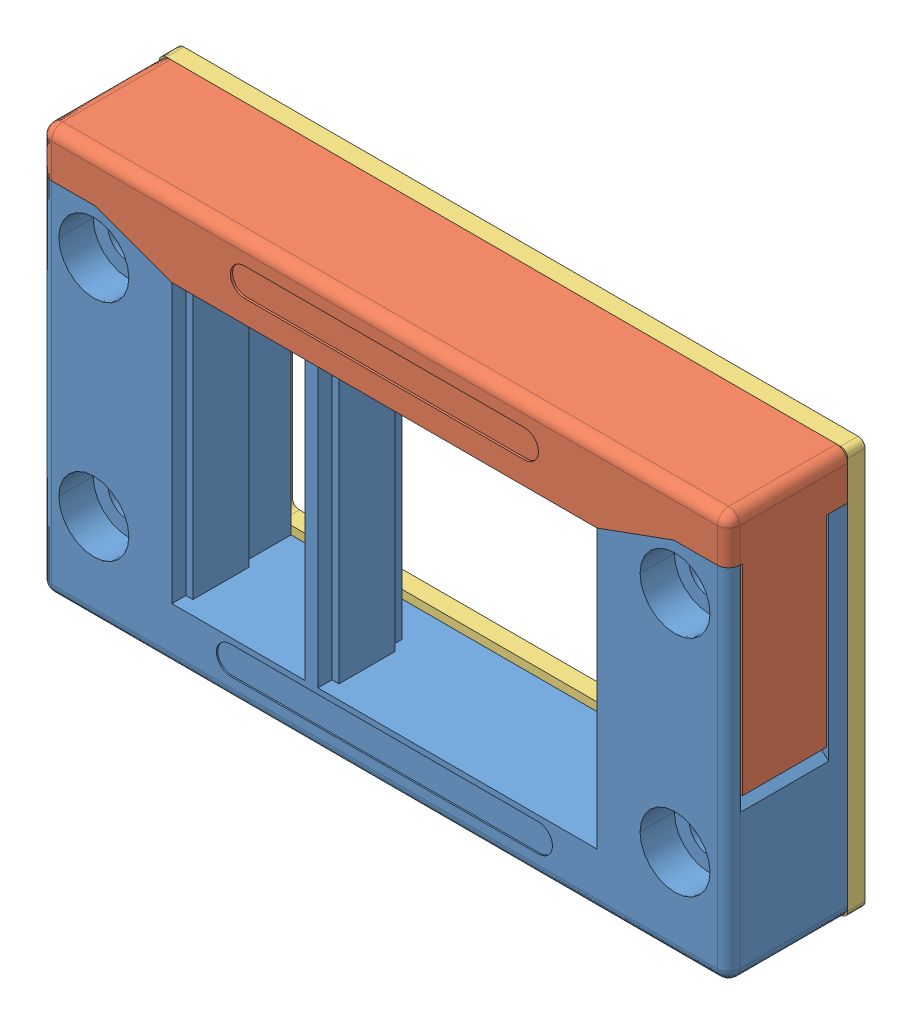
SolidWorks assembly 42427.SLDASM, configuration Default (file format 8000). Lengths in mm.
Overall size (98.3 58 19.5).
3 component instances, 3 part files, 0 mates.
Components (placement in the parent):
- 42427_01-1: 42427_01.SLDPRT [Default] at origin size (98.3 51.5 17)
- 42427_02-1: 42427_02.SLDPRT [Default] at origin size (98.3 35.2 17)
- 42427_03-1: 42427_03.SLDPRT [Default] at origin size (98.3 58 2.5)
